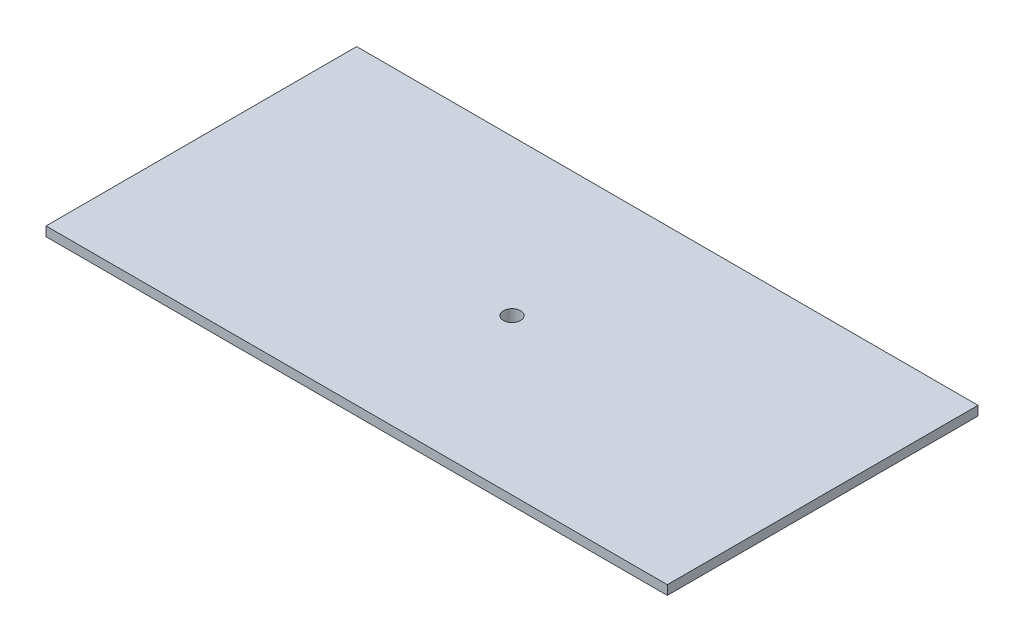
from build123d import *

# Parameters (mm, degrees)
SKETCH2_W           = 200
SKETCH2_H           = 100
BOSS_EXTRUDE1_DEPTH = 3
SKETCH3_R           = 2.75
CUT_EXTRUDE1_DEPTH  = 3
SKETCH4_W           = 7
SKETCH4_H           = 7
SKETCH4_R           = 2.75
BOSS_EXTRUDE2_DEPTH = 6
SKETCH5_R           = 5
SKETCH5_R_2         = 2.75
BOSS_EXTRUDE3_DEPTH = 1.5


with BuildPart() as part:
    # Sketch2 → Boss-Extrude1 (new body)
    with BuildSketch(Plane(origin=(0, 0, 0), x_dir=(1, 0, 0), z_dir=(0, 1, 0))):
        Rectangle(SKETCH2_W, SKETCH2_H)
    extrude(amount=BOSS_EXTRUDE1_DEPTH)

    # Sketch3 → Cut-Extrude1 (cut)
    with BuildSketch(Plane(origin=(0, 3, 0), x_dir=(1, 0, 0), z_dir=(0, 1, 0))):
        with Locations(Location((0, 0, 0), (0, 0, 270))):
            Circle(SKETCH3_R)
    extrude(amount=-CUT_EXTRUDE1_DEPTH, mode=Mode.SUBTRACT)

    # Sketch4 → Boss-Extrude2 (add)
    with BuildSketch(Plane.XZ):
        Rectangle(SKETCH4_W, SKETCH4_H)
        with Locations(Location((0, 0, 0), (0, 0, 90))):
            Circle(SKETCH4_R, mode=Mode.SUBTRACT)
    extrude(amount=BOSS_EXTRUDE2_DEPTH)

    # Sketch5 → Boss-Extrude3 (add)
    with BuildSketch(Plane.XZ):
        with Locations(Location((0, 0, 0), (0, 0, 270))):
            Circle(SKETCH5_R)
        with Locations(Location((0, 0, 0), (0, 0, 90))):
            Circle(SKETCH5_R_2, mode=Mode.SUBTRACT)
    extrude(amount=BOSS_EXTRUDE3_DEPTH)


solid = part.part
